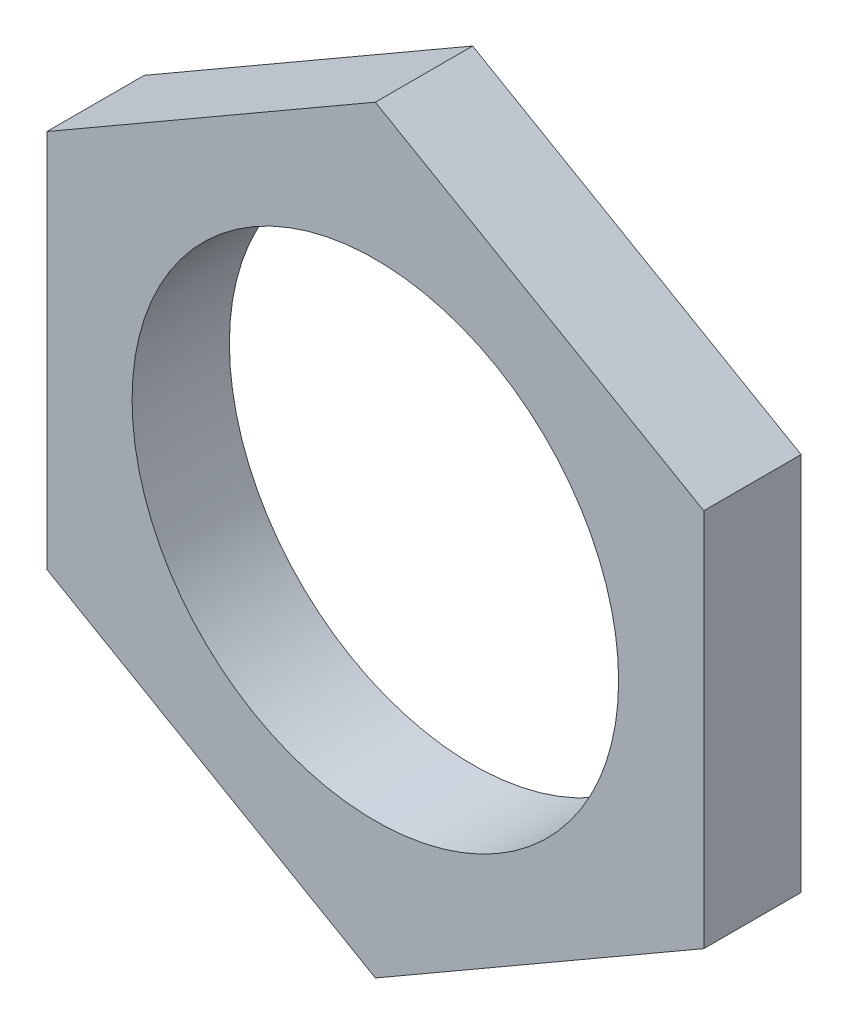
ISO-10303-21;
HEADER;
FILE_DESCRIPTION(('STEP AP214'),'2;1');
FILE_NAME('part.step','',(''),(''),'','','');
FILE_SCHEMA(('AUTOMOTIVE_DESIGN { 1 0 10303 214 1 1 1 1 }'));
ENDSEC;
DATA;
#1=APPLICATION_CONTEXT('core data for automotive mechanical design processes');
#2=APPLICATION_PROTOCOL_DEFINITION('international standard','automotive_design',2000,#1);
#3=PRODUCT_CONTEXT('',#1,'mechanical');
#4=PRODUCT('Part','Part','',(#3));
#5=PRODUCT_RELATED_PRODUCT_CATEGORY('part','',(#4));
#6=PRODUCT_DEFINITION_FORMATION('','',#4);
#7=PRODUCT_DEFINITION_CONTEXT('part definition',#1,'design');
#8=PRODUCT_DEFINITION('design','',#6,#7);
#9=PRODUCT_DEFINITION_SHAPE('','',#8);
#10=(LENGTH_UNIT() NAMED_UNIT(*) SI_UNIT(.MILLI.,.METRE.));
#11=(NAMED_UNIT(*) PLANE_ANGLE_UNIT() SI_UNIT($,.RADIAN.));
#12=(NAMED_UNIT(*) SI_UNIT($,.STERADIAN.) SOLID_ANGLE_UNIT());
#13=UNCERTAINTY_MEASURE_WITH_UNIT(LENGTH_MEASURE(1.E-05),#10,'distance_accuracy_value','');
#14=(GEOMETRIC_REPRESENTATION_CONTEXT(3) GLOBAL_UNCERTAINTY_ASSIGNED_CONTEXT((#13)) GLOBAL_UNIT_ASSIGNED_CONTEXT((#10,
#11,#12)) REPRESENTATION_CONTEXT('',''));
#15=CARTESIAN_POINT('',(0.,0.,0.));
#16=DIRECTION('',(0.,0.,1.));
#17=DIRECTION('',(1.,0.,0.));
#18=AXIS2_PLACEMENT_3D('',#15,#16,#17);
#19=CARTESIAN_POINT('',(0.,15.58845726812,4.));
#20=DIRECTION('',(0.,0.,-1.));
#21=DIRECTION('',(-1.,0.,0.));
#22=AXIS2_PLACEMENT_3D('',#19,#20,#21);
#23=PLANE('',#22);
#24=DIRECTION('',(-0.866025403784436,0.5,0.));
#25=VECTOR('',#24,1.);
#26=CARTESIAN_POINT('',(13.5,7.79422863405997,4.));
#27=LINE('',#26,#25);
#28=CARTESIAN_POINT('',(13.5,7.79422863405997,4.));
#29=VERTEX_POINT('',#28);
#30=CARTESIAN_POINT('',(0.,15.58845726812,4.));
#31=VERTEX_POINT('',#30);
#32=EDGE_CURVE('E100',#29,#31,#27,.T.);
#33=ORIENTED_EDGE('',*,*,#32,.T.);
#34=DIRECTION('',(0.866025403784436,0.5,0.));
#35=VECTOR('',#34,1.);
#36=CARTESIAN_POINT('',(-13.5,7.79422863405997,4.));
#37=LINE('',#36,#35);
#38=CARTESIAN_POINT('',(-13.5,7.79422863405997,4.));
#39=VERTEX_POINT('',#38);
#40=EDGE_CURVE('E73',#39,#31,#37,.T.);
#41=ORIENTED_EDGE('',*,*,#40,.F.);
#42=DIRECTION('',(0.,-1.,0.));
#43=VECTOR('',#42,1.);
#44=CARTESIAN_POINT('',(-13.5,7.79422863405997,4.));
#45=LINE('',#44,#43);
#46=CARTESIAN_POINT('',(-13.5,-7.79422863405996,4.));
#47=VERTEX_POINT('',#46);
#48=EDGE_CURVE('E103',#39,#47,#45,.T.);
#49=ORIENTED_EDGE('',*,*,#48,.T.);
#50=DIRECTION('',(0.86602540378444,-0.5,0.));
#51=VECTOR('',#50,1.);
#52=CARTESIAN_POINT('',(-13.5,-7.79422863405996,4.));
#53=LINE('',#52,#51);
#54=CARTESIAN_POINT('',(0.,-15.5884572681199,4.));
#55=VERTEX_POINT('',#54);
#56=EDGE_CURVE('E106',#47,#55,#53,.T.);
#57=ORIENTED_EDGE('',*,*,#56,.T.);
#58=DIRECTION('',(-0.86602540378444,-0.5,0.));
#59=VECTOR('',#58,1.);
#60=CARTESIAN_POINT('',(13.5,-7.79422863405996,4.));
#61=LINE('',#60,#59);
#62=CARTESIAN_POINT('',(13.5,-7.79422863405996,4.));
#63=VERTEX_POINT('',#62);
#64=EDGE_CURVE('E109',#63,#55,#61,.T.);
#65=ORIENTED_EDGE('',*,*,#64,.F.);
#66=DIRECTION('',(0.,-1.,0.));
#67=VECTOR('',#66,1.);
#68=CARTESIAN_POINT('',(13.5,7.79422863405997,4.));
#69=LINE('',#68,#67);
#70=EDGE_CURVE('E111',#29,#63,#69,.T.);
#71=ORIENTED_EDGE('',*,*,#70,.F.);
#72=EDGE_LOOP('',(#33,#41,#49,#57,#65,#71));
#73=FACE_BOUND('',#72,.T.);
#74=CARTESIAN_POINT('',(0.,0.,4.));
#75=DIRECTION('',(0.,0.,1.));
#76=DIRECTION('',(1.,0.,0.));
#77=AXIS2_PLACEMENT_3D('',#74,#75,#76);
#78=CIRCLE('',#77,10.);
#79=CARTESIAN_POINT('',(10.,0.,4.));
#80=VERTEX_POINT('',#79);
#81=EDGE_CURVE('E81',#80,#80,#78,.T.);
#82=ORIENTED_EDGE('',*,*,#81,.F.);
#83=EDGE_LOOP('',(#82));
#84=FACE_BOUND('',#83,.T.);
#85=ADVANCED_FACE('F14',(#73,#84),#23,.F.);
#86=CARTESIAN_POINT('',(0.,15.58845726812,0.));
#87=DIRECTION('',(0.,0.,-1.));
#88=DIRECTION('',(-1.,0.,0.));
#89=AXIS2_PLACEMENT_3D('',#86,#87,#88);
#90=PLANE('',#89);
#91=DIRECTION('',(-0.866025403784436,0.5,0.));
#92=VECTOR('',#91,1.);
#93=CARTESIAN_POINT('',(13.5,7.79422863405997,0.));
#94=LINE('',#93,#92);
#95=CARTESIAN_POINT('',(13.5,7.79422863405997,0.));
#96=VERTEX_POINT('',#95);
#97=CARTESIAN_POINT('',(0.,15.58845726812,0.));
#98=VERTEX_POINT('',#97);
#99=EDGE_CURVE('E77',#96,#98,#94,.T.);
#100=ORIENTED_EDGE('',*,*,#99,.F.);
#101=DIRECTION('',(0.,-1.,0.));
#102=VECTOR('',#101,1.);
#103=CARTESIAN_POINT('',(13.5,7.79422863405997,0.));
#104=LINE('',#103,#102);
#105=CARTESIAN_POINT('',(13.5,-7.79422863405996,0.));
#106=VERTEX_POINT('',#105);
#107=EDGE_CURVE('E98',#96,#106,#104,.T.);
#108=ORIENTED_EDGE('',*,*,#107,.T.);
#109=DIRECTION('',(-0.86602540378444,-0.5,0.));
#110=VECTOR('',#109,1.);
#111=CARTESIAN_POINT('',(13.5,-7.79422863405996,0.));
#112=LINE('',#111,#110);
#113=CARTESIAN_POINT('',(0.,-15.5884572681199,0.));
#114=VERTEX_POINT('',#113);
#115=EDGE_CURVE('E95',#106,#114,#112,.T.);
#116=ORIENTED_EDGE('',*,*,#115,.T.);
#117=DIRECTION('',(0.86602540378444,-0.5,0.));
#118=VECTOR('',#117,1.);
#119=CARTESIAN_POINT('',(-13.5,-7.79422863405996,0.));
#120=LINE('',#119,#118);
#121=CARTESIAN_POINT('',(-13.5,-7.79422863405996,0.));
#122=VERTEX_POINT('',#121);
#123=EDGE_CURVE('E89',#122,#114,#120,.T.);
#124=ORIENTED_EDGE('',*,*,#123,.F.);
#125=DIRECTION('',(0.,-1.,0.));
#126=VECTOR('',#125,1.);
#127=CARTESIAN_POINT('',(-13.5,7.79422863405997,0.));
#128=LINE('',#127,#126);
#129=CARTESIAN_POINT('',(-13.5,7.79422863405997,0.));
#130=VERTEX_POINT('',#129);
#131=EDGE_CURVE('E87',#130,#122,#128,.T.);
#132=ORIENTED_EDGE('',*,*,#131,.F.);
#133=DIRECTION('',(0.866025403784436,0.5,0.));
#134=VECTOR('',#133,1.);
#135=CARTESIAN_POINT('',(-13.5,7.79422863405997,0.));
#136=LINE('',#135,#134);
#137=EDGE_CURVE('E70',#130,#98,#136,.T.);
#138=ORIENTED_EDGE('',*,*,#137,.T.);
#139=EDGE_LOOP('',(#100,#108,#116,#124,#132,#138));
#140=FACE_BOUND('',#139,.T.);
#141=CARTESIAN_POINT('',(0.,0.,0.));
#142=DIRECTION('',(0.,0.,1.));
#143=DIRECTION('',(1.,0.,0.));
#144=AXIS2_PLACEMENT_3D('',#141,#142,#143);
#145=CIRCLE('',#144,10.);
#146=CARTESIAN_POINT('',(10.,0.,0.));
#147=VERTEX_POINT('',#146);
#148=EDGE_CURVE('E164',#147,#147,#145,.T.);
#149=ORIENTED_EDGE('',*,*,#148,.T.);
#150=EDGE_LOOP('',(#149));
#151=FACE_BOUND('',#150,.T.);
#152=ADVANCED_FACE('F83',(#140,#151),#90,.T.);
#153=CARTESIAN_POINT('',(13.5,7.79422863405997,4.));
#154=DIRECTION('',(-0.5,-0.866025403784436,0.));
#155=DIRECTION('',(0.866025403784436,-0.5,0.));
#156=AXIS2_PLACEMENT_3D('',#153,#154,#155);
#157=PLANE('',#156);
#158=DIRECTION('',(0.,0.,-1.));
#159=VECTOR('',#158,1.);
#160=CARTESIAN_POINT('',(0.,15.58845726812,4.));
#161=LINE('',#160,#159);
#162=EDGE_CURVE('E9',#31,#98,#161,.T.);
#163=ORIENTED_EDGE('',*,*,#162,.F.);
#164=ORIENTED_EDGE('',*,*,#32,.F.);
#165=DIRECTION('',(0.,0.,-1.));
#166=VECTOR('',#165,1.);
#167=CARTESIAN_POINT('',(13.5,7.79422863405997,4.));
#168=LINE('',#167,#166);
#169=EDGE_CURVE('E29',#29,#96,#168,.T.);
#170=ORIENTED_EDGE('',*,*,#169,.T.);
#171=ORIENTED_EDGE('',*,*,#99,.T.);
#172=EDGE_LOOP('',(#163,#164,#170,#171));
#173=FACE_BOUND('',#172,.T.);
#174=ADVANCED_FACE('F78',(#173),#157,.F.);
#175=CARTESIAN_POINT('',(-13.5,7.79422863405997,4.));
#176=DIRECTION('',(-0.5,0.866025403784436,0.));
#177=DIRECTION('',(-0.866025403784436,-0.5,0.));
#178=AXIS2_PLACEMENT_3D('',#175,#176,#177);
#179=PLANE('',#178);
#180=DIRECTION('',(0.,0.,-1.));
#181=VECTOR('',#180,1.);
#182=CARTESIAN_POINT('',(-13.5,7.79422863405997,4.));
#183=LINE('',#182,#181);
#184=EDGE_CURVE('E22',#39,#130,#183,.T.);
#185=ORIENTED_EDGE('',*,*,#184,.F.);
#186=ORIENTED_EDGE('',*,*,#40,.T.);
#187=ORIENTED_EDGE('',*,*,#162,.T.);
#188=ORIENTED_EDGE('',*,*,#137,.F.);
#189=EDGE_LOOP('',(#185,#186,#187,#188));
#190=FACE_BOUND('',#189,.T.);
#191=ADVANCED_FACE('F16',(#190),#179,.T.);
#192=CARTESIAN_POINT('',(-13.5,7.79422863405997,4.));
#193=DIRECTION('',(1.,0.,0.));
#194=DIRECTION('',(0.,1.,0.));
#195=AXIS2_PLACEMENT_3D('',#192,#193,#194);
#196=PLANE('',#195);
#197=DIRECTION('',(0.,0.,-1.));
#198=VECTOR('',#197,1.);
#199=CARTESIAN_POINT('',(-13.5,-7.79422863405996,4.));
#200=LINE('',#199,#198);
#201=EDGE_CURVE('E117',#47,#122,#200,.T.);
#202=ORIENTED_EDGE('',*,*,#201,.F.);
#203=ORIENTED_EDGE('',*,*,#48,.F.);
#204=ORIENTED_EDGE('',*,*,#184,.T.);
#205=ORIENTED_EDGE('',*,*,#131,.T.);
#206=EDGE_LOOP('',(#202,#203,#204,#205));
#207=FACE_BOUND('',#206,.T.);
#208=ADVANCED_FACE('F120',(#207),#196,.F.);
#209=CARTESIAN_POINT('',(-13.5,-7.79422863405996,4.));
#210=DIRECTION('',(0.5,0.86602540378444,0.));
#211=DIRECTION('',(-0.86602540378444,0.5,0.));
#212=AXIS2_PLACEMENT_3D('',#209,#210,#211);
#213=PLANE('',#212);
#214=DIRECTION('',(0.,0.,-1.));
#215=VECTOR('',#214,1.);
#216=CARTESIAN_POINT('',(0.,-15.5884572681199,4.));
#217=LINE('',#216,#215);
#218=EDGE_CURVE('E115',#55,#114,#217,.T.);
#219=ORIENTED_EDGE('',*,*,#218,.F.);
#220=ORIENTED_EDGE('',*,*,#56,.F.);
#221=ORIENTED_EDGE('',*,*,#201,.T.);
#222=ORIENTED_EDGE('',*,*,#123,.T.);
#223=EDGE_LOOP('',(#219,#220,#221,#222));
#224=FACE_BOUND('',#223,.T.);
#225=ADVANCED_FACE('F128',(#224),#213,.F.);
#226=CARTESIAN_POINT('',(13.5,-7.79422863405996,4.));
#227=DIRECTION('',(0.5,-0.86602540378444,0.));
#228=DIRECTION('',(0.86602540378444,0.5,0.));
#229=AXIS2_PLACEMENT_3D('',#226,#227,#228);
#230=PLANE('',#229);
#231=DIRECTION('',(0.,0.,-1.));
#232=VECTOR('',#231,1.);
#233=CARTESIAN_POINT('',(13.5,-7.79422863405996,4.));
#234=LINE('',#233,#232);
#235=EDGE_CURVE('E37',#63,#106,#234,.T.);
#236=ORIENTED_EDGE('',*,*,#235,.F.);
#237=ORIENTED_EDGE('',*,*,#64,.T.);
#238=ORIENTED_EDGE('',*,*,#218,.T.);
#239=ORIENTED_EDGE('',*,*,#115,.F.);
#240=EDGE_LOOP('',(#236,#237,#238,#239));
#241=FACE_BOUND('',#240,.T.);
#242=ADVANCED_FACE('F126',(#241),#230,.T.);
#243=CARTESIAN_POINT('',(13.5,7.79422863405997,4.));
#244=DIRECTION('',(1.,0.,0.));
#245=DIRECTION('',(0.,1.,0.));
#246=AXIS2_PLACEMENT_3D('',#243,#244,#245);
#247=PLANE('',#246);
#248=ORIENTED_EDGE('',*,*,#70,.T.);
#249=ORIENTED_EDGE('',*,*,#235,.T.);
#250=ORIENTED_EDGE('',*,*,#107,.F.);
#251=ORIENTED_EDGE('',*,*,#169,.F.);
#252=EDGE_LOOP('',(#248,#249,#250,#251));
#253=FACE_BOUND('',#252,.T.);
#254=ADVANCED_FACE('F125',(#253),#247,.T.);
#255=CARTESIAN_POINT('',(0.,0.,4.));
#256=DIRECTION('',(0.,0.,-1.));
#257=DIRECTION('',(-1.,0.,0.));
#258=AXIS2_PLACEMENT_3D('',#255,#256,#257);
#259=CYLINDRICAL_SURFACE('',#258,10.);
#260=ORIENTED_EDGE('',*,*,#81,.T.);
#261=EDGE_LOOP('',(#260));
#262=FACE_BOUND('',#261,.T.);
#263=ORIENTED_EDGE('',*,*,#148,.F.);
#264=EDGE_LOOP('',(#263));
#265=FACE_BOUND('',#264,.T.);
#266=ADVANCED_FACE('F150',(#262,#265),#259,.F.);
#267=CLOSED_SHELL('',(#85,#152,#174,#191,#208,#225,#242,#254,#266));
#268=MANIFOLD_SOLID_BREP('B1',#267);
#269=ADVANCED_BREP_SHAPE_REPRESENTATION('',(#18,#268),#14);
#270=SHAPE_DEFINITION_REPRESENTATION(#9,#269);
ENDSEC;
END-ISO-10303-21;
